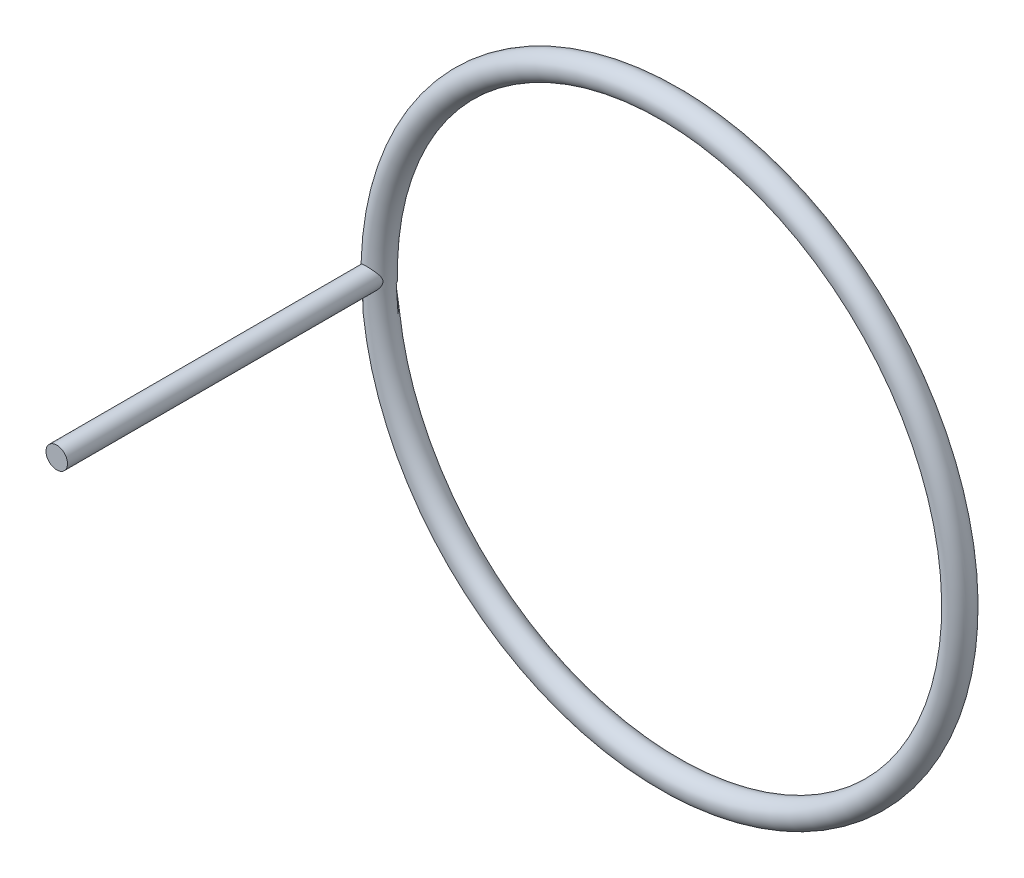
ISO-10303-21;
HEADER;
FILE_DESCRIPTION(('STEP AP214'),'2;1');
FILE_NAME('part.step','',(''),(''),'','','');
FILE_SCHEMA(('AUTOMOTIVE_DESIGN { 1 0 10303 214 1 1 1 1 }'));
ENDSEC;
DATA;
#1=APPLICATION_CONTEXT('core data for automotive mechanical design processes');
#2=APPLICATION_PROTOCOL_DEFINITION('international standard','automotive_design',2000,#1);
#3=PRODUCT_CONTEXT('',#1,'mechanical');
#4=PRODUCT('Part','Part','',(#3));
#5=PRODUCT_RELATED_PRODUCT_CATEGORY('part','',(#4));
#6=PRODUCT_DEFINITION_FORMATION('','',#4);
#7=PRODUCT_DEFINITION_CONTEXT('part definition',#1,'design');
#8=PRODUCT_DEFINITION('design','',#6,#7);
#9=PRODUCT_DEFINITION_SHAPE('','',#8);
#10=(LENGTH_UNIT() NAMED_UNIT(*) SI_UNIT(.MILLI.,.METRE.));
#11=(NAMED_UNIT(*) PLANE_ANGLE_UNIT() SI_UNIT($,.RADIAN.));
#12=(NAMED_UNIT(*) SI_UNIT($,.STERADIAN.) SOLID_ANGLE_UNIT());
#13=UNCERTAINTY_MEASURE_WITH_UNIT(LENGTH_MEASURE(1.E-05),#10,'distance_accuracy_value','');
#14=(GEOMETRIC_REPRESENTATION_CONTEXT(3) GLOBAL_UNCERTAINTY_ASSIGNED_CONTEXT((#13)) GLOBAL_UNIT_ASSIGNED_CONTEXT((#10,
#11,#12)) REPRESENTATION_CONTEXT('',''));
#15=CARTESIAN_POINT('',(0.,0.,0.));
#16=DIRECTION('',(0.,0.,1.));
#17=DIRECTION('',(1.,0.,0.));
#18=AXIS2_PLACEMENT_3D('',#15,#16,#17);
#19=CARTESIAN_POINT('',(137.16,0.,0.));
#20=DIRECTION('',(0.,0.,1.));
#21=DIRECTION('',(1.,0.,0.));
#22=AXIS2_PLACEMENT_3D('',#19,#20,#21);
#23=TOROIDAL_SURFACE('',#22,137.16,6.08);
#24=CARTESIAN_POINT('',(-5.06777379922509,-0.352233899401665,3.358518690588));
#25=CARTESIAN_POINT('',(-5.06063582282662,-0.45496528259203,3.36890361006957));
#26=CARTESIAN_POINT('',(-5.05039550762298,-0.557002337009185,3.38374953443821));
#27=CARTESIAN_POINT('',(-5.0240351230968,-0.75884244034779,3.42140318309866));
#28=CARTESIAN_POINT('',(-5.00791177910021,-0.858644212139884,3.44421534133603));
#29=CARTESIAN_POINT('',(-4.95117361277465,-1.15440024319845,3.52296090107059));
#30=CARTESIAN_POINT('',(-4.90223695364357,-1.34609163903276,3.58912885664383));
#31=CARTESIAN_POINT('',(-4.80114726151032,-1.66598629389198,3.71843195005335));
#32=CARTESIAN_POINT('',(-4.75342258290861,-1.79736723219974,3.7775706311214));
#33=CARTESIAN_POINT('',(-4.64856345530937,-2.05338055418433,3.90202696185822));
#34=CARTESIAN_POINT('',(-4.59142391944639,-2.17800924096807,3.96734794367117));
#35=CARTESIAN_POINT('',(-4.46820773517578,-2.4207595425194,4.10180347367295));
#36=CARTESIAN_POINT('',(-4.40212192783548,-2.53887431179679,4.17094188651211));
#37=CARTESIAN_POINT('',(-4.26135681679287,-2.76864262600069,4.31109351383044));
#38=CARTESIAN_POINT('',(-4.18667905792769,-2.88029732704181,4.38210638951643));
#39=CARTESIAN_POINT('',(-4.02452163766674,-3.1031662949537,4.5284161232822));
#40=CARTESIAN_POINT('',(-3.93656438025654,-3.21402026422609,4.60373425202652));
#41=CARTESIAN_POINT('',(-3.75132628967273,-3.42841430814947,4.7532506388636));
#42=CARTESIAN_POINT('',(-3.65404445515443,-3.53195359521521,4.82744877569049));
#43=CARTESIAN_POINT('',(-3.34851124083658,-3.83079213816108,5.04608335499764));
#44=CARTESIAN_POINT('',(-3.12619934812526,-4.01482697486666,5.18690886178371));
#45=CARTESIAN_POINT('',(-2.68421982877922,-4.31985547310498,5.42679173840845));
#46=CARTESIAN_POINT('',(-2.46997009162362,-4.44623257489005,5.52891905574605));
#47=CARTESIAN_POINT('',(-2.13110984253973,-4.61309649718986,5.66639013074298));
#48=CARTESIAN_POINT('',(-2.01519258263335,-4.66495027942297,5.70960789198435));
#49=CARTESIAN_POINT('',(-1.77800554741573,-4.76040106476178,5.78997673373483));
#50=CARTESIAN_POINT('',(-1.65673822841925,-4.80400180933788,5.8271305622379));
#51=CARTESIAN_POINT('',(-1.40824541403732,-4.88266309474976,5.89491730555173));
#52=CARTESIAN_POINT('',(-1.28097230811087,-4.91763345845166,5.92548097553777));
#53=CARTESIAN_POINT('',(-1.02259745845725,-4.97777791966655,5.97883355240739));
#54=CARTESIAN_POINT('',(-0.891497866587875,-5.0029574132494,6.00162674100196));
#55=CARTESIAN_POINT('',(-0.626640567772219,-5.04297986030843,6.03881161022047));
#56=CARTESIAN_POINT('',(-0.4928847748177,-5.05782999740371,6.05320912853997));
#57=CARTESIAN_POINT('',(-0.223968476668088,-5.07684914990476,6.07317794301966));
#58=CARTESIAN_POINT('',(-0.088808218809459,-5.08102001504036,6.07875076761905));
#59=CARTESIAN_POINT('',(0.161247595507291,-5.07874167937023,6.08071555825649));
#60=CARTESIAN_POINT('',(0.276151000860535,-5.07378735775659,6.07835582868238));
#61=CARTESIAN_POINT('',(0.505079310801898,-5.05613264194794,6.06714090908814));
#62=CARTESIAN_POINT('',(0.61910393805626,-5.04342989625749,6.0582837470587));
#63=CARTESIAN_POINT('',(0.845330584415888,-5.01047638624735,6.03423750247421));
#64=CARTESIAN_POINT('',(0.9575333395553,-4.99022875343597,6.01905104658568));
#65=CARTESIAN_POINT('',(1.17940688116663,-4.94249929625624,5.98263998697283));
#66=CARTESIAN_POINT('',(1.28907668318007,-4.91501470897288,5.96141307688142));
#67=CARTESIAN_POINT('',(1.60707619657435,-4.8240316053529,5.89059453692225));
#68=CARTESIAN_POINT('',(1.81102908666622,-4.75099642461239,5.83311905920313));
#69=CARTESIAN_POINT('',(2.20304172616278,-4.58242929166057,5.70031646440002));
#70=CARTESIAN_POINT('',(2.39109557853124,-4.48688904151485,5.62498276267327));
#71=CARTESIAN_POINT('',(2.6980424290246,-4.30684760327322,5.48403394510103));
#72=CARTESIAN_POINT('',(2.82131452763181,-4.22702543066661,5.42181766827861));
#73=CARTESIAN_POINT('',(3.05856089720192,-4.0586649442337,5.29171217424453));
#74=CARTESIAN_POINT('',(3.17253482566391,-3.97012630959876,5.223822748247));
#75=CARTESIAN_POINT('',(3.39131441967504,-3.78496771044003,5.08359651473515));
#76=CARTESIAN_POINT('',(3.49609714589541,-3.68832864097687,5.01124930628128));
#77=CARTESIAN_POINT('',(3.69618596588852,-3.48778894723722,4.86365061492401));
#78=CARTESIAN_POINT('',(3.79149319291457,-3.38388919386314,4.78839948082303));
#79=CARTESIAN_POINT('',(3.97441299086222,-3.16716479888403,4.63497473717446));
#80=CARTESIAN_POINT('',(4.06184517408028,-3.05420818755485,4.55677276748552));
#81=CARTESIAN_POINT('',(4.22697033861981,-2.82126093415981,4.40048034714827));
#82=CARTESIAN_POINT('',(4.30466089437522,-2.70126855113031,4.32238992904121));
#83=CARTESIAN_POINT('',(4.45007076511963,-2.45433748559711,4.16842529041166));
#84=CARTESIAN_POINT('',(4.51780540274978,-2.32740989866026,4.09254781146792));
#85=CARTESIAN_POINT('',(4.6431004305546,-2.06615406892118,3.94542093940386));
#86=CARTESIAN_POINT('',(4.70066696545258,-1.93183036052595,3.87416876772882));
#87=CARTESIAN_POINT('',(4.81343075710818,-1.63301357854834,3.72870542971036));
#88=CARTESIAN_POINT('',(4.86677186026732,-1.46713417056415,3.65584809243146));
#89=CARTESIAN_POINT('',(4.95712748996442,-1.12450664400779,3.5278766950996));
#90=CARTESIAN_POINT('',(4.99417736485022,-0.947783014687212,3.47272429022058));
#91=CARTESIAN_POINT('',(5.04524959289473,-0.613089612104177,3.39517552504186));
#92=CARTESIAN_POINT('',(5.06194182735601,-0.456430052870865,3.3690395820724));
#93=CARTESIAN_POINT('',(5.08052758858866,-0.140155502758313,3.33987821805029));
#94=CARTESIAN_POINT('',(5.08243877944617,0.0194557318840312,3.33682521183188));
#95=CARTESIAN_POINT('',(5.07132090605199,0.33658386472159,3.35433587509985));
#96=CARTESIAN_POINT('',(5.05830830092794,0.49410287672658,3.37487352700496));
#97=CARTESIAN_POINT('',(5.018488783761,0.803495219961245,3.43599713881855));
#98=CARTESIAN_POINT('',(4.99165699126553,0.95535783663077,3.4766192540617));
#99=CARTESIAN_POINT('',(4.93241812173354,1.22162286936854,3.56300073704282));
#100=CARTESIAN_POINT('',(4.90221058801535,1.33742675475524,3.60609306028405));
#101=CARTESIAN_POINT('',(4.8346682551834,1.56408843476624,3.69927116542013));
#102=CARTESIAN_POINT('',(4.79732896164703,1.67494305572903,3.7493613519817));
#103=CARTESIAN_POINT('',(4.7159088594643,1.89211544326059,3.85461243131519));
#104=CARTESIAN_POINT('',(4.67180624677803,1.99841706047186,3.90978948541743));
#105=CARTESIAN_POINT('',(4.57728911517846,2.20632252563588,4.02340564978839));
#106=CARTESIAN_POINT('',(4.52687517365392,2.30792680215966,4.08184446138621));
#107=CARTESIAN_POINT('',(4.39664860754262,2.54992708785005,4.22652011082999));
#108=CARTESIAN_POINT('',(4.31358795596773,2.68796861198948,4.31378969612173));
#109=CARTESIAN_POINT('',(4.13508011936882,2.95522266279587,4.48927083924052));
#110=CARTESIAN_POINT('',(4.03962763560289,3.08443137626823,4.57748278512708));
#111=CARTESIAN_POINT('',(3.83647999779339,3.33370921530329,4.75225641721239));
#112=CARTESIAN_POINT('',(3.72880193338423,3.45379071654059,4.83882021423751));
#113=CARTESIAN_POINT('',(3.50113989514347,3.68438419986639,5.00818321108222));
#114=CARTESIAN_POINT('',(3.38116122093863,3.79490026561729,5.0909840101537));
#115=CARTESIAN_POINT('',(3.06366828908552,4.05983423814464,5.29200715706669));
#116=CARTESIAN_POINT('',(2.85800801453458,4.20760550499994,5.40655035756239));
#117=CARTESIAN_POINT('',(2.52926607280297,4.4074565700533,5.56273507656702));
#118=CARTESIAN_POINT('',(2.41632984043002,4.47043096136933,5.61218498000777));
#119=CARTESIAN_POINT('',(2.18400521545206,4.58840546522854,5.7049989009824));
#120=CARTESIAN_POINT('',(2.06462081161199,4.64341043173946,5.74836662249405));
#121=CARTESIAN_POINT('',(1.83949989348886,4.73656218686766,5.82173722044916));
#122=CARTESIAN_POINT('',(1.73462941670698,4.77599835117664,5.85276839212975));
#123=CARTESIAN_POINT('',(1.52122366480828,4.84819100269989,5.90937645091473));
#124=CARTESIAN_POINT('',(1.41269015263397,4.88095065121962,5.93495591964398));
#125=CARTESIAN_POINT('',(1.19251331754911,4.93936069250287,5.98021901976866));
#126=CARTESIAN_POINT('',(1.08086991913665,4.96501091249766,5.99990250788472));
#127=CARTESIAN_POINT('',(0.855245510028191,5.00880766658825,6.03299344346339));
#128=CARTESIAN_POINT('',(0.741265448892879,5.02695718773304,6.04640338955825));
#129=CARTESIAN_POINT('',(0.511316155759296,5.05553454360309,6.06673673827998));
#130=CARTESIAN_POINT('',(0.39534096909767,5.06593248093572,6.07363505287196));
#131=CARTESIAN_POINT('',(0.162789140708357,5.07872575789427,6.08072747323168));
#132=CARTESIAN_POINT('',(0.0462127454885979,5.08112415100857,6.08092413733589));
#133=CARTESIAN_POINT('',(-0.18667526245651,5.07790485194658,6.0746401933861));
#134=CARTESIAN_POINT('',(-0.302986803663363,5.07228520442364,6.06815795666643));
#135=CARTESIAN_POINT('',(-0.534400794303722,5.0531472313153,6.04868115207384));
#136=CARTESIAN_POINT('',(-0.649503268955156,5.03962907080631,6.03568672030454));
#137=CARTESIAN_POINT('',(-0.871587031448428,5.0058635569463,6.00433835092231));
#138=CARTESIAN_POINT('',(-0.978674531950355,4.98601258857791,5.98630642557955));
#139=CARTESIAN_POINT('',(-1.19040624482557,4.93974625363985,5.94501002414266));
#140=CARTESIAN_POINT('',(-1.29504965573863,4.91332876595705,5.92174385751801));
#141=CARTESIAN_POINT('',(-1.60443726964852,4.82474045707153,5.84468214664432));
#142=CARTESIAN_POINT('',(-1.80478370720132,4.75321114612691,5.78360217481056));
#143=CARTESIAN_POINT('',(-2.20969992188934,4.58006182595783,5.63871910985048));
#144=CARTESIAN_POINT('',(-2.41266573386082,4.47613804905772,5.55324785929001));
#145=CARTESIAN_POINT('',(-2.79821873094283,4.24580457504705,5.36810817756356));
#146=CARTESIAN_POINT('',(-2.98079706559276,4.11938517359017,5.26843362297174));
#147=CARTESIAN_POINT('',(-3.36097897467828,3.81847469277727,5.03754198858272));
#148=CARTESIAN_POINT('',(-3.55367140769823,3.63946486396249,4.90409909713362));
#149=CARTESIAN_POINT('',(-3.81910785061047,3.35228997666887,4.69970633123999));
#150=CARTESIAN_POINT('',(-3.90373738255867,3.25332931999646,4.63078826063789));
#151=CARTESIAN_POINT('',(-4.06507184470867,3.04934308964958,4.49267046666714));
#152=CARTESIAN_POINT('',(-4.14177915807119,2.94431935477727,4.42347083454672));
#153=CARTESIAN_POINT('',(-4.28600008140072,2.73002126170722,4.28717061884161));
#154=CARTESIAN_POINT('',(-4.35364293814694,2.62084382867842,4.22005420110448));
#155=CARTESIAN_POINT('',(-4.48102602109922,2.3965483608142,4.08818585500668));
#156=CARTESIAN_POINT('',(-4.54076451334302,2.28142903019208,4.02343444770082));
#157=CARTESIAN_POINT('',(-4.65190736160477,2.04527685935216,3.89820274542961));
#158=CARTESIAN_POINT('',(-4.70332635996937,1.92425490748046,3.83771505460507));
#159=CARTESIAN_POINT('',(-4.79740411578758,1.6759840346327,3.72319300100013));
#160=CARTESIAN_POINT('',(-4.84006843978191,1.5487391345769,3.66915454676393));
#161=CARTESIAN_POINT('',(-4.92549196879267,1.25493775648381,3.55782994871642));
#162=CARTESIAN_POINT('',(-4.96556317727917,1.08655827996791,3.50315990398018));
#163=CARTESIAN_POINT('',(-5.02864717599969,0.741380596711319,3.41521202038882));
#164=CARTESIAN_POINT('',(-5.05170707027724,0.564607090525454,3.38187514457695));
#165=CARTESIAN_POINT('',(-5.07465286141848,0.263412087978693,3.34852045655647));
#166=CARTESIAN_POINT('',(-5.07956633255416,0.140149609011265,3.34129236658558));
#167=CARTESIAN_POINT('',(-5.0803778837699,-0.106481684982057,3.34010666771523));
#168=CARTESIAN_POINT('',(-5.07627723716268,-0.229850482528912,3.346147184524));
#169=CARTESIAN_POINT('',(-5.06777379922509,-0.352233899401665,3.358518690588));
#170=B_SPLINE_CURVE_WITH_KNOTS('',3,(#24,#25,#26,#27,#28,#29,#30,#31,#32,#33,#34,#35,#36,#37,
#38,#39,#40,#41,#42,#43,#44,#45,#46,#47,#48,#49,#50,#51,#52,#53,#54,#55,#56,#57,#58,#59,#60,#61,
#62,#63,#64,#65,#66,#67,#68,#69,#70,#71,#72,#73,#74,#75,#76,#77,#78,#79,#80,#81,#82,#83,#84,#85,
#86,#87,#88,#89,#90,#91,#92,#93,#94,#95,#96,#97,#98,#99,#100,#101,#102,#103,#104,#105,#106,#107,
#108,#109,#110,#111,#112,#113,#114,#115,#116,#117,#118,#119,#120,#121,#122,#123,#124,#125,#126,
#127,#128,#129,#130,#131,#132,#133,#134,#135,#136,#137,#138,#139,#140,#141,#142,#143,#144,#145,
#146,#147,#148,#149,#150,#151,#152,#153,#154,#155,#156,#157,#158,#159,#160,#161,#162,#163,#164,
#165,#166,#167,#168,#169),.UNSPECIFIED.,.T.,.F.,(4,2,2,2,2,2,2,2,2,2,2,2,2,2,2,2,2,2,2,2,2,2,2,
2,2,2,2,2,2,2,2,2,2,2,2,2,2,2,2,2,2,2,2,2,2,2,2,2,2,2,2,2,2,2,2,2,2,2,2,2,2,2,2,2,2,2,2,2,2,2,2,
2,4),(0.,0.310326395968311,0.620825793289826,1.24365577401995,1.69848034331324,2.15355146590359,
2.60909205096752,3.06455085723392,3.54499962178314,4.02550003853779,4.98434676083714,
5.78769585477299,6.18969019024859,6.59150184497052,6.99734933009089,7.40297282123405,
7.80831393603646,8.21358483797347,8.55825047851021,8.90302077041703,9.24764812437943,
9.59240724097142,10.261921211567,10.9316824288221,11.4095639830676,11.8874631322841,
12.3665229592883,12.845525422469,13.333619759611,13.8218353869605,14.3092915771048,
14.7964521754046,15.3616373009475,15.9255899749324,16.402581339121,16.8790025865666,
17.3548989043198,17.8316550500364,18.2127324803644,18.5940508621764,18.9766254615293,
19.3591650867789,19.9081311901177,20.4573328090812,21.0057759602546,21.5539838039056,
22.3840827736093,22.7989996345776,23.2136627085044,23.5620902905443,23.9103525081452,
24.2586231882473,24.6067550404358,24.9562227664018,25.3055570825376,25.6549766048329,
26.0043888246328,26.3352066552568,26.666131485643,27.3275415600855,28.0555124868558,
28.7837982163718,29.6651978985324,30.106923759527,30.5485163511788,30.9829261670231,
31.4174311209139,31.8511628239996,32.2846178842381,32.8273552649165,33.3685841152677,
33.7383267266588,34.108017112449),.UNSPECIFIED.);
#171=CARTESIAN_POINT('',(-5.06777379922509,-0.352233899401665,3.358518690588));
#172=VERTEX_POINT('',#171);
#173=EDGE_CURVE('E11',#172,#172,#170,.T.);
#174=ORIENTED_EDGE('',*,*,#173,.F.);
#175=EDGE_LOOP('',(#174));
#176=FACE_BOUND('',#175,.T.);
#177=ADVANCED_FACE('F35',(#176),#23,.T.);
#178=CARTESIAN_POINT('',(0.,0.,152.4));
#179=DIRECTION('',(0.,0.,-1.));
#180=DIRECTION('',(-1.,0.,0.));
#181=AXIS2_PLACEMENT_3D('',#178,#179,#180);
#182=CYLINDRICAL_SURFACE('',#181,5.08);
#183=CARTESIAN_POINT('',(0.,0.,152.4));
#184=DIRECTION('',(0.,0.,1.));
#185=DIRECTION('',(1.,0.,0.));
#186=AXIS2_PLACEMENT_3D('',#183,#184,#185);
#187=CIRCLE('',#186,5.08);
#188=CARTESIAN_POINT('',(5.08,0.,152.4));
#189=VERTEX_POINT('',#188);
#190=EDGE_CURVE('E66',#189,#189,#187,.T.);
#191=ORIENTED_EDGE('',*,*,#190,.F.);
#192=EDGE_LOOP('',(#191));
#193=FACE_BOUND('',#192,.T.);
#194=ORIENTED_EDGE('',*,*,#173,.T.);
#195=EDGE_LOOP('',(#194));
#196=FACE_BOUND('',#195,.T.);
#197=ADVANCED_FACE('F78',(#193,#196),#182,.T.);
#198=CARTESIAN_POINT('',(0.,0.,152.4));
#199=DIRECTION('',(0.,0.,1.));
#200=DIRECTION('',(1.,0.,0.));
#201=AXIS2_PLACEMENT_3D('',#198,#199,#200);
#202=PLANE('',#201);
#203=ORIENTED_EDGE('',*,*,#190,.T.);
#204=EDGE_LOOP('',(#203));
#205=FACE_BOUND('',#204,.T.);
#206=ADVANCED_FACE('F92',(#205),#202,.T.);
#207=CLOSED_SHELL('',(#177,#197,#206));
#208=CARTESIAN_POINT('',(137.16,0.,0.));
#209=DIRECTION('',(0.,0.,1.));
#210=DIRECTION('',(1.,0.,0.));
#211=AXIS2_PLACEMENT_3D('',#208,#209,#210);
#212=TOROIDAL_SURFACE('',#211,137.16,5.08);
#213=CARTESIAN_POINT('',(-5.08000000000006,0.,0.));
#214=CARTESIAN_POINT('',(-5.07999999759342,-0.00345243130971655,0.0033902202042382));
#215=CARTESIAN_POINT('',(-5.07999647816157,-0.00690494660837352,0.00678052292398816));
#216=CARTESIAN_POINT('',(-5.07919989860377,-0.397728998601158,0.390562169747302));
#217=CARTESIAN_POINT('',(-5.03412925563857,-0.786092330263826,0.771932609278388));
#218=CARTESIAN_POINT('',(-4.89859364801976,-1.35978383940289,1.33608887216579));
#219=CARTESIAN_POINT('',(-4.8419362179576,-1.54986008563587,1.52314131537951));
#220=CARTESIAN_POINT('',(-4.70517925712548,-1.92550840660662,1.89322095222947));
#221=CARTESIAN_POINT('',(-4.62509206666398,-2.11108279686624,2.07625021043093));
#222=CARTESIAN_POINT('',(-4.46632448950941,-2.42488345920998,2.38622440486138));
#223=CARTESIAN_POINT('',(-4.39347145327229,-2.55467972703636,2.51458480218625));
#224=CARTESIAN_POINT('',(-4.2347270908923,-2.81000012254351,2.76742942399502));
#225=CARTESIAN_POINT('',(-4.14883320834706,-2.9355234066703,2.89191288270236));
#226=CARTESIAN_POINT('',(-3.87123966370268,-3.30366438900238,3.25762803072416));
#227=CARTESIAN_POINT('',(-3.65923453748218,-3.53865397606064,3.49191486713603));
#228=CARTESIAN_POINT('',(-3.24080506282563,-3.91937397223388,3.87339600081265));
#229=CARTESIAN_POINT('',(-3.0472334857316,-4.07243519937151,4.02740577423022));
#230=CARTESIAN_POINT('',(-2.62830241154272,-4.35453891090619,4.31277923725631));
#231=CARTESIAN_POINT('',(-2.40298337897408,-4.48361149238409,4.44417128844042));
#232=CARTESIAN_POINT('',(-1.97133416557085,-4.68666362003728,4.65261922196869));
#233=CARTESIAN_POINT('',(-1.77054141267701,-4.76651177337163,4.73529198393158));
#234=CARTESIAN_POINT('',(-1.45737711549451,-4.86770275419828,4.84128674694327));
#235=CARTESIAN_POINT('',(-1.35096580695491,-4.89834139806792,4.8736216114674));
#236=CARTESIAN_POINT('',(-1.13470836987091,-4.95290339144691,4.93174027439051));
#237=CARTESIAN_POINT('',(-1.02486377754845,-4.97682969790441,4.95752695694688));
#238=CARTESIAN_POINT('',(-0.801574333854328,-5.01765501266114,5.00222092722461));
#239=CARTESIAN_POINT('',(-0.688108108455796,-5.03449785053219,5.021073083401));
#240=CARTESIAN_POINT('',(-0.459348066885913,-5.06049815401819,5.05118553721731));
#241=CARTESIAN_POINT('',(-0.344055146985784,-5.06965927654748,5.06244944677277));
#242=CARTESIAN_POINT('',(-0.11263264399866,-5.08007157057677,5.07711470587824));
#243=CARTESIAN_POINT('',(0.00349677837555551,-5.08132422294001,5.08051752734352));
#244=CARTESIAN_POINT('',(0.235520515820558,-5.07586390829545,5.07935510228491));
#245=CARTESIAN_POINT('',(0.351414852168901,-5.06915169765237,5.07479061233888));
#246=CARTESIAN_POINT('',(0.56855590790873,-5.04912052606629,5.05875674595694));
#247=CARTESIAN_POINT('',(0.669946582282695,-5.03665538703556,5.04814694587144));
#248=CARTESIAN_POINT('',(0.871018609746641,-5.0058057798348,5.02093467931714));
#249=CARTESIAN_POINT('',(0.970699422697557,-4.98741947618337,5.00433035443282));
#250=CARTESIAN_POINT('',(1.26613572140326,-4.92379596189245,4.94589595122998));
#251=CARTESIAN_POINT('',(1.4584677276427,-4.87007662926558,4.89543035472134));
#252=CARTESIAN_POINT('',(1.8359436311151,-4.74098494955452,4.77234861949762));
#253=CARTESIAN_POINT('',(2.02062413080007,-4.66494146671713,4.69904078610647));
#254=CARTESIAN_POINT('',(2.37335939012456,-4.49576313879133,4.53459506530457));
#255=CARTESIAN_POINT('',(2.5414058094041,-4.40261978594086,4.44344830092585));
#256=CARTESIAN_POINT('',(2.94688782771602,-4.14809503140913,4.19302484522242));
#257=CARTESIAN_POINT('',(3.17222720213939,-3.97718960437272,4.02369003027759));
#258=CARTESIAN_POINT('',(3.47903658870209,-3.70426511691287,3.7518330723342));
#259=CARTESIAN_POINT('',(3.57624773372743,-3.6103519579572,3.65806014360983));
#260=CARTESIAN_POINT('',(3.76059821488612,-3.41789757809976,3.46548807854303));
#261=CARTESIAN_POINT('',(3.84773990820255,-3.31935744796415,3.36669012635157));
#262=CARTESIAN_POINT('',(4.045248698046,-3.07822446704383,3.12450016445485));
#263=CARTESIAN_POINT('',(4.15092693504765,-2.93380416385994,2.97910515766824));
#264=CARTESIAN_POINT('',(4.34412549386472,-2.63931742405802,2.68205612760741));
#265=CARTESIAN_POINT('',(4.43163772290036,-2.48924850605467,2.53039935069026));
#266=CARTESIAN_POINT('',(4.58934573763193,-2.18487787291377,2.22234569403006));
#267=CARTESIAN_POINT('',(4.65953653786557,-2.03057495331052,2.06594746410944));
#268=CARTESIAN_POINT('',(4.78326768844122,-1.71896479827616,1.74974650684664));
#269=CARTESIAN_POINT('',(4.83681256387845,-1.56165839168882,1.58994471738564));
#270=CARTESIAN_POINT('',(4.94830061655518,-1.17378605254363,1.19559784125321));
#271=CARTESIAN_POINT('',(4.99742825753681,-0.942032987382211,0.959702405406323));
#272=CARTESIAN_POINT('',(5.06301455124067,-0.476801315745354,0.485882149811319));
#273=CARTESIAN_POINT('',(5.0795318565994,-0.243326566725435,0.24796174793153));
#274=CARTESIAN_POINT('',(5.07999672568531,-0.00665606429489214,0.00678285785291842));
#275=CARTESIAN_POINT('',(5.0799999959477,-0.00332801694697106,0.00339141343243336));
#276=CARTESIAN_POINT('',(5.08000000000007,0.,0.));
#277=B_SPLINE_CURVE_WITH_KNOTS('',3,(#213,#214,#215,#216,#217,#218,#219,#220,#221,#222,#223,
#224,#225,#226,#227,#228,#229,#230,#231,#232,#233,#234,#235,#236,#237,#238,#239,#240,#241,#242,
#243,#244,#245,#246,#247,#248,#249,#250,#251,#252,#253,#254,#255,#256,#257,#258,#259,#260,#261,
#262,#263,#264,#265,#266,#267,#268,#269,#270,#271,#272,#273,#274,#275,#276),.UNSPECIFIED.,.F.,
.F.,(4,2,2,2,2,2,2,2,2,2,2,2,2,2,2,2,2,2,2,2,2,2,2,2,2,2,2,2,2,2,2,4),(0.,0.0145164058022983,
1.64321677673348,2.46040116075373,3.27715591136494,3.8663045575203,4.45556884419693,
5.63055486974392,6.50035648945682,7.36905934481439,8.06013918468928,8.40584736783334,
8.75140301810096,9.09964941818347,9.44772993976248,9.79574528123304,10.143727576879,
10.451466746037,10.7593014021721,11.3744253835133,12.0103622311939,12.6466163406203,
13.6296252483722,14.1228428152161,14.6159446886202,15.3066723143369,15.9977069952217,
16.688940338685,17.3799856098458,18.38124175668,19.3806954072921,19.3949502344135),.UNSPECIFIED.);
#278=CARTESIAN_POINT('',(-5.08,0.,0.));
#279=VERTEX_POINT('',#278);
#280=CARTESIAN_POINT('',(5.08,0.,0.));
#281=VERTEX_POINT('',#280);
#282=EDGE_CURVE('E60',#279,#281,#277,.T.);
#283=ORIENTED_EDGE('',*,*,#282,.T.);
#284=CARTESIAN_POINT('',(5.08000000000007,0.,0.));
#285=CARTESIAN_POINT('',(5.07999999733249,0.00332802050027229,0.00339141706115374));
#286=CARTESIAN_POINT('',(5.07999672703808,0.00665606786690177,0.00678286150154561));
#287=CARTESIAN_POINT('',(5.07960415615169,0.20647711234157,0.210410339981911));
#288=CARTESIAN_POINT('',(5.06782609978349,0.403051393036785,0.410727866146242));
#289=CARTESIAN_POINT('',(5.0212828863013,0.795063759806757,0.810043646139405));
#290=CARTESIAN_POINT('',(4.98649908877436,0.990500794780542,1.00904069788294));
#291=CARTESIAN_POINT('',(4.89328816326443,1.37918357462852,1.40448057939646));
#292=CARTESIAN_POINT('',(4.83481347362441,1.57242410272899,1.60091744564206));
#293=CARTESIAN_POINT('',(4.69333511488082,1.95461211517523,1.98893597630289));
#294=CARTESIAN_POINT('',(4.61034653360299,2.14356216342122,2.18052054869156));
#295=CARTESIAN_POINT('',(4.44984229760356,2.45461646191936,2.49535431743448));
#296=CARTESIAN_POINT('',(4.37936520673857,2.57842806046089,2.62051646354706));
#297=CARTESIAN_POINT('',(4.22622561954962,2.82244284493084,2.86683218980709));
#298=CARTESIAN_POINT('',(4.14356081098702,2.94264534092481,2.98798500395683));
#299=CARTESIAN_POINT('',(3.87681209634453,3.29601190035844,3.34350784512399));
#300=CARTESIAN_POINT('',(3.67359477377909,3.52269264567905,3.5707096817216));
#301=CARTESIAN_POINT('',(3.27136323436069,3.89347476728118,3.94043987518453));
#302=CARTESIAN_POINT('',(3.08445347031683,4.04390655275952,4.08979805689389));
#303=CARTESIAN_POINT('',(2.67949981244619,4.32283970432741,4.36523275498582));
#304=CARTESIAN_POINT('',(2.46149554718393,4.45136853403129,4.49133844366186));
#305=CARTESIAN_POINT('',(2.04248927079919,4.65590668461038,4.69032984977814));
#306=CARTESIAN_POINT('',(1.84682761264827,4.73727906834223,4.76881613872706));
#307=CARTESIAN_POINT('',(1.5415017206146,4.84167193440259,4.86834761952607));
#308=CARTESIAN_POINT('',(1.43772998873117,4.87353034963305,4.89849642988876));
#309=CARTESIAN_POINT('',(1.22679887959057,4.93085060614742,4.95224699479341));
#310=CARTESIAN_POINT('',(1.11964097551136,4.95631518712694,4.97585155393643));
#311=CARTESIAN_POINT('',(0.901924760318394,5.00053534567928,5.01622155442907));
#312=CARTESIAN_POINT('',(0.79134879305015,5.01924595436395,5.03294125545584));
#313=CARTESIAN_POINT('',(0.568338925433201,5.04936116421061,5.05899621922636));
#314=CARTESIAN_POINT('',(0.455905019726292,5.06076574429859,5.06833146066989));
#315=CARTESIAN_POINT('',(0.230179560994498,5.07604282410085,5.07943717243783));
#316=CARTESIAN_POINT('',(0.116888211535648,5.07991705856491,5.08120938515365));
#317=CARTESIAN_POINT('',(-0.109557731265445,5.08008029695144,5.07718253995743));
#318=CARTESIAN_POINT('',(-0.222712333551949,5.07636982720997,5.07138400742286));
#319=CARTESIAN_POINT('',(-0.436680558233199,5.06221622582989,5.05331896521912));
#320=CARTESIAN_POINT('',(-0.537601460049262,5.05248001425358,5.04175371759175));
#321=CARTESIAN_POINT('',(-0.737876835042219,5.02714076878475,5.01283486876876));
#322=CARTESIAN_POINT('',(-0.83723078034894,5.01153580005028,4.99547935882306));
#323=CARTESIAN_POINT('',(-1.13194823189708,4.95630303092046,4.93515577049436));
#324=CARTESIAN_POINT('',(-1.32414070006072,4.90824526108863,4.88391530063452));
#325=CARTESIAN_POINT('',(-1.70621616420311,4.7893143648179,4.75904745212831));
#326=CARTESIAN_POINT('',(-1.89538813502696,4.71732981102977,4.68434192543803));
#327=CARTESIAN_POINT('',(-2.25747366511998,4.55517464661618,4.51748759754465));
#328=CARTESIAN_POINT('',(-2.43037803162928,4.46499384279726,4.42532902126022));
#329=CARTESIAN_POINT('',(-2.84835172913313,4.21667851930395,4.17295510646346));
#330=CARTESIAN_POINT('',(-3.08146353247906,4.04827706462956,4.00300289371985));
#331=CARTESIAN_POINT('',(-3.50654235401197,3.68630629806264,3.63962046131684));
#332=CARTESIAN_POINT('',(-3.69840269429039,3.49267376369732,3.44613134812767));
#333=CARTESIAN_POINT('',(-3.98780312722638,3.15224660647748,3.10714760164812));
#334=CARTESIAN_POINT('',(-4.09596316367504,3.01006152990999,2.96588148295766));
#335=CARTESIAN_POINT('',(-4.29453941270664,2.719254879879,2.67748533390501));
#336=CARTESIAN_POINT('',(-4.38494848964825,2.57063074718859,2.53035297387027));
#337=CARTESIAN_POINT('',(-4.54863033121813,2.26845692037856,2.23163923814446));
#338=CARTESIAN_POINT('',(-4.62189804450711,2.11490578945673,2.08005656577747));
#339=CARTESIAN_POINT('',(-4.75180637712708,1.80418408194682,1.77365095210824));
#340=CARTESIAN_POINT('',(-4.80845110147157,1.64701440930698,1.61882882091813));
#341=CARTESIAN_POINT('',(-4.93136088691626,1.24597930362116,1.22409446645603));
#342=CARTESIAN_POINT('',(-4.9868061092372,1.00032535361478,0.982585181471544));
#343=CARTESIAN_POINT('',(-5.06083295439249,0.506508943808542,0.497383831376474));
#344=CARTESIAN_POINT('',(-5.0794840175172,0.258352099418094,0.253696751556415));
#345=CARTESIAN_POINT('',(-5.07999647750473,0.00690499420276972,0.00678056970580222));
#346=CARTESIAN_POINT('',(-5.07999999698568,0.00345247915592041,0.00339026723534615));
#347=CARTESIAN_POINT('',(-5.08000000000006,0.,0.));
#348=B_SPLINE_CURVE_WITH_KNOTS('',3,(#284,#285,#286,#287,#288,#289,#290,#291,#292,#293,#294,
#295,#296,#297,#298,#299,#300,#301,#302,#303,#304,#305,#306,#307,#308,#309,#310,#311,#312,#313,
#314,#315,#316,#317,#318,#319,#320,#321,#322,#323,#324,#325,#326,#327,#328,#329,#330,#331,#332,
#333,#334,#335,#336,#337,#338,#339,#340,#341,#342,#343,#344,#345,#346,#347),.UNSPECIFIED.,.F.,
.F.,(4,2,2,2,2,2,2,2,2,2,2,2,2,2,2,2,2,2,2,2,2,2,2,2,2,2,2,2,2,2,2,4),(0.,0.0142548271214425,
0.855875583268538,1.69817909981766,2.54218206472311,3.385666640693,3.95412246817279,
4.52268628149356,5.65641481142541,6.5014757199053,7.34546910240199,8.02041596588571,
8.35803840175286,8.69551592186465,9.03520068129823,9.37488642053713,9.71449389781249,
10.0540778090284,10.3598601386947,10.665743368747,11.276992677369,11.9219289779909,
12.5672275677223,13.5638279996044,14.5629754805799,15.2454034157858,15.928105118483,
16.6110077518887,17.2937416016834,18.3384207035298,19.3811263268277,19.39564273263),.UNSPECIFIED.);
#349=EDGE_CURVE('E39',#281,#279,#348,.T.);
#350=ORIENTED_EDGE('',*,*,#349,.T.);
#351=EDGE_LOOP('',(#283,#350));
#352=FACE_BOUND('',#351,.T.);
#353=ADVANCED_FACE('F71',(#352),#212,.F.);
#354=ORIENTED_EDGE('',*,*,#349,.F.);
#355=CARTESIAN_POINT('',(0.,0.,0.));
#356=DIRECTION('',(0.,0.,1.));
#357=DIRECTION('',(1.,0.,0.));
#358=AXIS2_PLACEMENT_3D('',#355,#356,#357);
#359=CIRCLE('',#358,5.08);
#360=EDGE_CURVE('E55',#281,#279,#359,.T.);
#361=ORIENTED_EDGE('',*,*,#360,.T.);
#362=EDGE_LOOP('',(#354,#361));
#363=FACE_BOUND('',#362,.T.);
#364=ADVANCED_FACE('F70',(#363),#182,.T.);
#365=CARTESIAN_POINT('',(0.,0.,0.));
#366=DIRECTION('',(0.,0.,1.));
#367=DIRECTION('',(1.,0.,0.));
#368=AXIS2_PLACEMENT_3D('',#365,#366,#367);
#369=PLANE('',#368);
#370=ORIENTED_EDGE('',*,*,#360,.F.);
#371=EDGE_CURVE('E62',#279,#281,#359,.T.);
#372=ORIENTED_EDGE('',*,*,#371,.F.);
#373=EDGE_LOOP('',(#370,#372));
#374=FACE_BOUND('',#373,.T.);
#375=ADVANCED_FACE('F67',(#374),#369,.F.);
#376=ORIENTED_EDGE('',*,*,#282,.F.);
#377=ORIENTED_EDGE('',*,*,#371,.T.);
#378=EDGE_LOOP('',(#376,#377));
#379=FACE_BOUND('',#378,.T.);
#380=ADVANCED_FACE('F61',(#379),#182,.T.);
#381=CLOSED_SHELL('',(#353,#364,#375,#380));
#382=ORIENTED_CLOSED_SHELL('',*,#207,.T.);
#383=BREP_WITH_VOIDS('B2',#381,(#382));
#384=ADVANCED_BREP_SHAPE_REPRESENTATION('',(#18,#383),#14);
#385=SHAPE_DEFINITION_REPRESENTATION(#9,#384);
ENDSEC;
END-ISO-10303-21;
